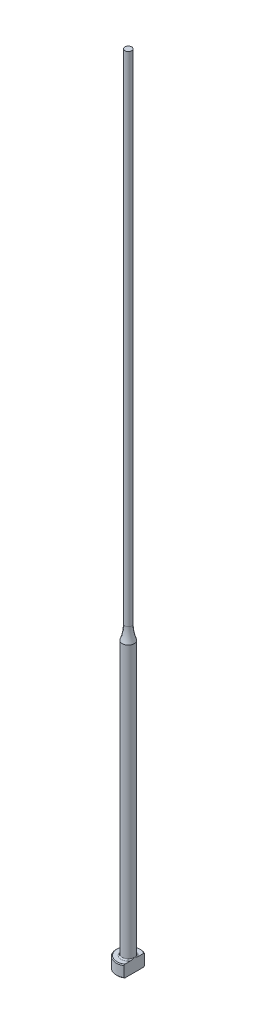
ISO-10303-21;
HEADER;
FILE_DESCRIPTION(('STEP AP214'),'2;1');
FILE_NAME('part.step','',(''),(''),'','','');
FILE_SCHEMA(('AUTOMOTIVE_DESIGN { 1 0 10303 214 1 1 1 1 }'));
ENDSEC;
DATA;
#1=APPLICATION_CONTEXT('core data for automotive mechanical design processes');
#2=APPLICATION_PROTOCOL_DEFINITION('international standard','automotive_design',2000,#1);
#3=PRODUCT_CONTEXT('',#1,'mechanical');
#4=PRODUCT('Part','Part','',(#3));
#5=PRODUCT_RELATED_PRODUCT_CATEGORY('part','',(#4));
#6=PRODUCT_DEFINITION_FORMATION('','',#4);
#7=PRODUCT_DEFINITION_CONTEXT('part definition',#1,'design');
#8=PRODUCT_DEFINITION('design','',#6,#7);
#9=PRODUCT_DEFINITION_SHAPE('','',#8);
#10=(LENGTH_UNIT() NAMED_UNIT(*) SI_UNIT(.MILLI.,.METRE.));
#11=(NAMED_UNIT(*) PLANE_ANGLE_UNIT() SI_UNIT($,.RADIAN.));
#12=(NAMED_UNIT(*) SI_UNIT($,.STERADIAN.) SOLID_ANGLE_UNIT());
#13=UNCERTAINTY_MEASURE_WITH_UNIT(LENGTH_MEASURE(1.E-05),#10,'distance_accuracy_value','');
#14=(GEOMETRIC_REPRESENTATION_CONTEXT(3) GLOBAL_UNCERTAINTY_ASSIGNED_CONTEXT((#13)) GLOBAL_UNIT_ASSIGNED_CONTEXT((#10,
#11,#12)) REPRESENTATION_CONTEXT('',''));
#15=CARTESIAN_POINT('',(0.,0.,0.));
#16=DIRECTION('',(0.,0.,1.));
#17=DIRECTION('',(1.,0.,0.));
#18=AXIS2_PLACEMENT_3D('',#15,#16,#17);
#19=CARTESIAN_POINT('',(-2.99999999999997,3.,0.));
#20=DIRECTION('',(0.,1.,0.));
#21=DIRECTION('',(0.,0.,1.));
#22=AXIS2_PLACEMENT_3D('',#19,#20,#21);
#23=PLANE('',#22);
#24=CARTESIAN_POINT('',(0.,3.,0.));
#25=DIRECTION('',(0.,1.,0.));
#26=DIRECTION('',(0.,0.,1.));
#27=AXIS2_PLACEMENT_3D('',#24,#25,#26);
#28=CIRCLE('',#27,2.79999999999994);
#29=CARTESIAN_POINT('',(1.49999999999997,3.,-2.36431808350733));
#30=VERTEX_POINT('',#29);
#31=CARTESIAN_POINT('',(1.49999999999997,3.,2.36431808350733));
#32=VERTEX_POINT('',#31);
#33=EDGE_CURVE('E187',#30,#32,#28,.T.);
#34=ORIENTED_EDGE('',*,*,#33,.T.);
#35=DIRECTION('',(0.,0.,-1.));
#36=VECTOR('',#35,1.);
#37=CARTESIAN_POINT('',(1.49999999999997,3.,0.));
#38=LINE('',#37,#36);
#39=CARTESIAN_POINT('',(1.49999999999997,3.00000000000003,0.99498743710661));
#40=VERTEX_POINT('',#39);
#41=EDGE_CURVE('E57',#32,#40,#38,.T.);
#42=ORIENTED_EDGE('',*,*,#41,.T.);
#43=CARTESIAN_POINT('',(0.,3.,0.));
#44=DIRECTION('',(0.,1.,0.));
#45=DIRECTION('',(0.,0.,1.));
#46=AXIS2_PLACEMENT_3D('',#43,#44,#45);
#47=CIRCLE('',#46,1.79999999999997);
#48=CARTESIAN_POINT('',(1.49999999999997,3.00000000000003,-0.994987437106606));
#49=VERTEX_POINT('',#48);
#50=EDGE_CURVE('E108',#40,#49,#47,.F.);
#51=ORIENTED_EDGE('',*,*,#50,.T.);
#52=EDGE_CURVE('E137',#49,#30,#38,.T.);
#53=ORIENTED_EDGE('',*,*,#52,.T.);
#54=EDGE_LOOP('',(#34,#42,#51,#53));
#55=FACE_BOUND('',#54,.T.);
#56=ADVANCED_FACE('F32',(#55),#23,.T.);
#57=CARTESIAN_POINT('',(0.,259.958771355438,0.));
#58=DIRECTION('',(0.,1.,0.));
#59=DIRECTION('',(0.,0.,1.));
#60=AXIS2_PLACEMENT_3D('',#57,#58,#59);
#61=CYLINDRICAL_SURFACE('',#60,2.99999999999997);
#62=CARTESIAN_POINT('',(0.,2.79999999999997,0.));
#63=DIRECTION('',(0.,1.,0.));
#64=DIRECTION('',(0.,0.,1.));
#65=AXIS2_PLACEMENT_3D('',#62,#63,#64);
#66=CIRCLE('',#65,2.99999999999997);
#67=CARTESIAN_POINT('',(1.49999999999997,2.79999999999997,2.5980762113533));
#68=VERTEX_POINT('',#67);
#69=CARTESIAN_POINT('',(1.49999999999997,2.79999999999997,-2.5980762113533));
#70=VERTEX_POINT('',#69);
#71=EDGE_CURVE('E105',#68,#70,#66,.F.);
#72=ORIENTED_EDGE('',*,*,#71,.T.);
#73=DIRECTION('',(0.,-1.,0.));
#74=VECTOR('',#73,1.);
#75=CARTESIAN_POINT('',(1.49999999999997,200.,-2.5980762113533));
#76=LINE('',#75,#74);
#77=CARTESIAN_POINT('',(1.49999999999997,0.200000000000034,-2.5980762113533));
#78=VERTEX_POINT('',#77);
#79=EDGE_CURVE('E193',#70,#78,#76,.T.);
#80=ORIENTED_EDGE('',*,*,#79,.T.);
#81=CARTESIAN_POINT('',(0.,0.200000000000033,0.));
#82=DIRECTION('',(0.,-1.,0.));
#83=DIRECTION('',(0.,0.,-1.));
#84=AXIS2_PLACEMENT_3D('',#81,#82,#83);
#85=CIRCLE('',#84,2.99999999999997);
#86=CARTESIAN_POINT('',(1.49999999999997,0.200000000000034,2.5980762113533));
#87=VERTEX_POINT('',#86);
#88=EDGE_CURVE('E100',#78,#87,#85,.F.);
#89=ORIENTED_EDGE('',*,*,#88,.T.);
#90=DIRECTION('',(0.,-1.,0.));
#91=VECTOR('',#90,1.);
#92=CARTESIAN_POINT('',(1.49999999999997,200.,2.5980762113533));
#93=LINE('',#92,#91);
#94=EDGE_CURVE('E93',#68,#87,#93,.T.);
#95=ORIENTED_EDGE('',*,*,#94,.F.);
#96=EDGE_LOOP('',(#72,#80,#89,#95));
#97=FACE_BOUND('',#96,.T.);
#98=ADVANCED_FACE('F158',(#97),#61,.T.);
#99=CARTESIAN_POINT('',(0.,0.,0.));
#100=DIRECTION('',(0.,-1.,0.));
#101=DIRECTION('',(0.,0.,-1.));
#102=AXIS2_PLACEMENT_3D('',#99,#100,#101);
#103=PLANE('',#102);
#104=CARTESIAN_POINT('',(0.,0.,0.));
#105=DIRECTION('',(0.,-1.,0.));
#106=DIRECTION('',(0.,0.,-1.));
#107=AXIS2_PLACEMENT_3D('',#104,#105,#106);
#108=CIRCLE('',#107,2.79999999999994);
#109=CARTESIAN_POINT('',(1.49999999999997,0.,2.36431808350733));
#110=VERTEX_POINT('',#109);
#111=CARTESIAN_POINT('',(1.49999999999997,0.,-2.36431808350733));
#112=VERTEX_POINT('',#111);
#113=EDGE_CURVE('E98',#110,#112,#108,.T.);
#114=ORIENTED_EDGE('',*,*,#113,.T.);
#115=DIRECTION('',(0.,0.,1.));
#116=VECTOR('',#115,1.);
#117=CARTESIAN_POINT('',(1.49999999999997,0.,-2.5980762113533));
#118=LINE('',#117,#116);
#119=EDGE_CURVE('E83',#112,#110,#118,.T.);
#120=ORIENTED_EDGE('',*,*,#119,.T.);
#121=EDGE_LOOP('',(#114,#120));
#122=FACE_BOUND('',#121,.T.);
#123=ADVANCED_FACE('F103',(#122),#103,.T.);
#124=CARTESIAN_POINT('',(0.,3.,0.));
#125=DIRECTION('',(0.,-1.,0.));
#126=DIRECTION('',(0.,0.,-1.));
#127=AXIS2_PLACEMENT_3D('',#124,#125,#126);
#128=CONICAL_SURFACE('',#127,2.79999999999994,0.785398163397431);
#129=ORIENTED_EDGE('',*,*,#71,.F.);
#130=CARTESIAN_POINT('',(1.49999999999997,-0.11174109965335,5.71827621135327));
#131=CARTESIAN_POINT('',(1.49999999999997,0.0136183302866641,5.58866816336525));
#132=CARTESIAN_POINT('',(1.49999999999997,0.138843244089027,5.45892957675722));
#133=CARTESIAN_POINT('',(1.49999999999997,0.388944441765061,5.19911365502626));
#134=CARTESIAN_POINT('',(1.49999999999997,0.513820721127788,5.06903631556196));
#135=CARTESIAN_POINT('',(1.49999999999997,0.763205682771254,4.80840180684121));
#136=CARTESIAN_POINT('',(1.49999999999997,0.887714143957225,4.67784442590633));
#137=CARTESIAN_POINT('',(1.49999999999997,1.13618059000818,4.4162081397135));
#138=CARTESIAN_POINT('',(1.49999999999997,1.26013857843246,4.28512923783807));
#139=CARTESIAN_POINT('',(1.49999999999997,1.50488975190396,4.02490837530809));
#140=CARTESIAN_POINT('',(1.49999999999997,1.62569693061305,3.8957795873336));
#141=CARTESIAN_POINT('',(1.49999999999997,1.86640694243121,3.63668213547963));
#142=CARTESIAN_POINT('',(1.49999999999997,1.98630978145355,3.50671347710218));
#143=CARTESIAN_POINT('',(1.49999999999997,2.2248603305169,3.24567921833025));
#144=CARTESIAN_POINT('',(1.49999999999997,2.3435083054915,3.11461386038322));
#145=CARTESIAN_POINT('',(1.49999999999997,2.5790771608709,2.85094268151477));
#146=CARTESIAN_POINT('',(1.49999999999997,2.69599811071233,2.71833692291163));
#147=CARTESIAN_POINT('',(1.49999999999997,2.88262371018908,2.50255231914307));
#148=CARTESIAN_POINT('',(1.49999999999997,2.95312454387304,2.42006293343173));
#149=CARTESIAN_POINT('',(1.49999999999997,3.09287098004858,2.25401084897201));
#150=CARTESIAN_POINT('',(1.49999999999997,3.16211645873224,2.17044804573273));
#151=CARTESIAN_POINT('',(1.49999999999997,3.29964684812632,2.00105967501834));
#152=CARTESIAN_POINT('',(1.49999999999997,3.36791386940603,1.9152195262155));
#153=CARTESIAN_POINT('',(1.49999999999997,3.50205840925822,1.7417139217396));
#154=CARTESIAN_POINT('',(1.49999999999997,3.56793649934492,1.65404891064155));
#155=CARTESIAN_POINT('',(1.49999999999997,3.69728151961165,1.47490236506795));
#156=CARTESIAN_POINT('',(1.49999999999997,3.76069661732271,1.38338308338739));
#157=CARTESIAN_POINT('',(1.49999999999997,3.88239539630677,1.19675661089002));
#158=CARTESIAN_POINT('',(1.49999999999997,3.94067201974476,1.10164473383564));
#159=CARTESIAN_POINT('',(1.49999999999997,4.048413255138,0.908008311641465));
#160=CARTESIAN_POINT('',(1.49999999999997,4.09797809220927,0.809540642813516));
#161=CARTESIAN_POINT('',(1.49999999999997,4.18432188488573,0.60719295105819));
#162=CARTESIAN_POINT('',(1.49999999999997,4.22114374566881,0.503332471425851));
#163=CARTESIAN_POINT('',(1.49999999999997,4.26099935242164,0.3475775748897));
#164=CARTESIAN_POINT('',(1.49999999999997,4.2715702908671,0.297609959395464));
#165=CARTESIAN_POINT('',(1.49999999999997,4.28794860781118,0.196885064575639));
#166=CARTESIAN_POINT('',(1.49999999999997,4.29375640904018,0.146127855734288));
#167=CARTESIAN_POINT('',(1.49999999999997,4.30019707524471,0.0444388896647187));
#168=CARTESIAN_POINT('',(1.49999999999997,4.30084594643,-0.00649183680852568));
#169=CARTESIAN_POINT('',(1.49999999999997,4.29696416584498,-0.108155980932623));
#170=CARTESIAN_POINT('',(1.49999999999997,4.29243308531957,-0.158889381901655));
#171=CARTESIAN_POINT('',(1.49999999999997,4.27856915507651,-0.259234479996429));
#172=CARTESIAN_POINT('',(1.49999999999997,4.2692782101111,-0.308852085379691));
#173=CARTESIAN_POINT('',(1.49999999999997,4.24647108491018,-0.407110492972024));
#174=CARTESIAN_POINT('',(1.49999999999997,4.23295324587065,-0.45575090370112));
#175=CARTESIAN_POINT('',(1.49999999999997,4.20226175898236,-0.55214996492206));
#176=CARTESIAN_POINT('',(1.49999999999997,4.18506801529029,-0.599902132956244));
#177=CARTESIAN_POINT('',(1.49999999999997,4.14771387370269,-0.694205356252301));
#178=CARTESIAN_POINT('',(1.49999999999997,4.12755408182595,-0.740756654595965));
#179=CARTESIAN_POINT('',(1.49999999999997,4.0632769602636,-0.879166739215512));
#180=CARTESIAN_POINT('',(1.49999999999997,4.01551721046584,-0.969329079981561));
#181=CARTESIAN_POINT('',(1.49999999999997,3.91367909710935,-1.14604316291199));
#182=CARTESIAN_POINT('',(1.49999999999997,3.85959300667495,-1.2325903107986));
#183=CARTESIAN_POINT('',(1.49999999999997,3.74697968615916,-1.40321348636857));
#184=CARTESIAN_POINT('',(1.49999999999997,3.68843573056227,-1.4872783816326));
#185=CARTESIAN_POINT('',(1.49999999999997,3.5684384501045,-1.65322187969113));
#186=CARTESIAN_POINT('',(1.49999999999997,3.50698656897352,-1.73510153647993));
#187=CARTESIAN_POINT('',(1.49999999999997,3.3811567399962,-1.89829823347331));
#188=CARTESIAN_POINT('',(1.49999999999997,3.31675092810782,-1.97959369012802));
#189=CARTESIAN_POINT('',(1.49999999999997,3.18634068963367,-2.14090082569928));
#190=CARTESIAN_POINT('',(1.49999999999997,3.12033609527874,-2.22091236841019));
#191=CARTESIAN_POINT('',(1.49999999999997,2.92086431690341,-2.45906508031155));
#192=CARTESIAN_POINT('',(1.49999999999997,2.78562663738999,-2.61572090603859));
#193=CARTESIAN_POINT('',(1.49999999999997,2.53554498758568,-2.90006295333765));
#194=CARTESIAN_POINT('',(1.49999999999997,2.42114543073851,-3.02814382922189));
#195=CARTESIAN_POINT('',(1.49999999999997,2.1909355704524,-3.28303767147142));
#196=CARTESIAN_POINT('',(1.49999999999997,2.07512522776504,-3.40985060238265));
#197=CARTESIAN_POINT('',(1.49999999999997,1.72597067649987,-3.78913849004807));
#198=CARTESIAN_POINT('',(1.49999999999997,1.49111760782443,-4.04022177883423));
#199=CARTESIAN_POINT('',(1.49999999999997,1.0288247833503,-4.52992803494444));
#200=CARTESIAN_POINT('',(1.49999999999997,0.801477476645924,-4.76863870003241));
#201=CARTESIAN_POINT('',(1.49999999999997,0.459548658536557,-5.12558036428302));
#202=CARTESIAN_POINT('',(1.49999999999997,0.345484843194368,-5.24430773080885));
#203=CARTESIAN_POINT('',(1.49999999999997,0.117071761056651,-5.48148573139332));
#204=CARTESIAN_POINT('',(1.49999999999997,0.00272249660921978,-5.59993636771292));
#205=CARTESIAN_POINT('',(1.49999999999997,-0.11174109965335,-5.71827621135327));
#206=B_SPLINE_CURVE_WITH_KNOTS('',3,(#130,#131,#132,#133,#134,#135,#136,#137,#138,#139,#140,
#141,#142,#143,#144,#145,#146,#147,#148,#149,#150,#151,#152,#153,#154,#155,#156,#157,#158,#159,
#160,#161,#162,#163,#164,#165,#166,#167,#168,#169,#170,#171,#172,#173,#174,#175,#176,#177,#178,
#179,#180,#181,#182,#183,#184,#185,#186,#187,#188,#189,#190,#191,#192,#193,#194,#195,#196,#197,
#198,#199,#200,#201,#202,#203,#204,#205),.UNSPECIFIED.,.F.,.F.,(4,2,2,2,2,2,2,2,2,2,2,2,2,2,2,2,
2,2,2,2,2,2,2,2,2,2,2,2,2,2,2,2,2,2,2,2,2,4),(0.,0.540943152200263,1.08189327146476,
1.62312052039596,2.16434426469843,2.69482920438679,3.22531067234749,3.75567781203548,
4.28602356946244,4.61155053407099,4.9371094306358,5.26610945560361,5.59503024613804,
5.92894782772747,6.26331713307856,6.59354403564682,6.92264800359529,7.07567478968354,
7.2286879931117,7.38122626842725,7.53377717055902,7.6850075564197,7.83629736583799,
7.98843643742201,8.14054446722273,8.44618799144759,8.75220879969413,9.05944044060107,
9.3665211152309,9.6776428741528,9.98879742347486,10.609592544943,11.1247803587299,
11.6399825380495,12.6713544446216,13.6603005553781,14.1542238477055,14.6481430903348),.UNSPECIFIED.);
#207=EDGE_CURVE('E136',#68,#32,#206,.T.);
#208=ORIENTED_EDGE('',*,*,#207,.T.);
#209=ORIENTED_EDGE('',*,*,#33,.F.);
#210=EDGE_CURVE('E128',#30,#70,#206,.T.);
#211=ORIENTED_EDGE('',*,*,#210,.T.);
#212=EDGE_LOOP('',(#129,#208,#209,#211));
#213=FACE_BOUND('',#212,.T.);
#214=ADVANCED_FACE('F144',(#213),#128,.T.);
#215=CARTESIAN_POINT('',(0.,0.200000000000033,0.));
#216=DIRECTION('',(0.,1.,0.));
#217=DIRECTION('',(0.,0.,1.));
#218=AXIS2_PLACEMENT_3D('',#215,#216,#217);
#219=CONICAL_SURFACE('',#218,2.99999999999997,0.785398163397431);
#220=ORIENTED_EDGE('',*,*,#88,.F.);
#221=CARTESIAN_POINT('',(1.49999999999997,3.11174109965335,-5.71827621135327));
#222=CARTESIAN_POINT('',(1.49999999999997,2.98638166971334,-5.58866816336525));
#223=CARTESIAN_POINT('',(1.49999999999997,2.86115675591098,-5.45892957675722));
#224=CARTESIAN_POINT('',(1.49999999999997,2.61105555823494,-5.19911365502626));
#225=CARTESIAN_POINT('',(1.49999999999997,2.48617927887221,-5.06903631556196));
#226=CARTESIAN_POINT('',(1.49999999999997,2.23679431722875,-4.80840180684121));
#227=CARTESIAN_POINT('',(1.49999999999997,2.11228585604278,-4.67784442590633));
#228=CARTESIAN_POINT('',(1.49999999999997,1.86381940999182,-4.4162081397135));
#229=CARTESIAN_POINT('',(1.49999999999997,1.73986142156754,-4.28512923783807));
#230=CARTESIAN_POINT('',(1.49999999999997,1.49511024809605,-4.02490837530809));
#231=CARTESIAN_POINT('',(1.49999999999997,1.37430306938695,-3.8957795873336));
#232=CARTESIAN_POINT('',(1.49999999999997,1.13359305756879,-3.63668213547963));
#233=CARTESIAN_POINT('',(1.49999999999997,1.01369021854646,-3.50671347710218));
#234=CARTESIAN_POINT('',(1.49999999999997,0.775139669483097,-3.24567921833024));
#235=CARTESIAN_POINT('',(1.49999999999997,0.656491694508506,-3.11461386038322));
#236=CARTESIAN_POINT('',(1.49999999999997,0.420922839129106,-2.85094268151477));
#237=CARTESIAN_POINT('',(1.49999999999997,0.304001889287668,-2.71833692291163));
#238=CARTESIAN_POINT('',(1.49999999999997,0.117376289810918,-2.50255231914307));
#239=CARTESIAN_POINT('',(1.49999999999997,0.0468754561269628,-2.42006293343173));
#240=CARTESIAN_POINT('',(1.49999999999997,-0.0928709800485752,-2.254010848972));
#241=CARTESIAN_POINT('',(1.49999999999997,-0.162116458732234,-2.17044804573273));
#242=CARTESIAN_POINT('',(1.49999999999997,-0.299646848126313,-2.00105967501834));
#243=CARTESIAN_POINT('',(1.49999999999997,-0.367913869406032,-1.9152195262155));
#244=CARTESIAN_POINT('',(1.49999999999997,-0.502058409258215,-1.7417139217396));
#245=CARTESIAN_POINT('',(1.49999999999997,-0.567936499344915,-1.65404891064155));
#246=CARTESIAN_POINT('',(1.49999999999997,-0.697281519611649,-1.47490236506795));
#247=CARTESIAN_POINT('',(1.49999999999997,-0.760696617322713,-1.38338308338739));
#248=CARTESIAN_POINT('',(1.49999999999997,-0.882395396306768,-1.19675661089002));
#249=CARTESIAN_POINT('',(1.49999999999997,-0.940672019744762,-1.10164473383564));
#250=CARTESIAN_POINT('',(1.49999999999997,-1.04841325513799,-0.908008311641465));
#251=CARTESIAN_POINT('',(1.49999999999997,-1.09797809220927,-0.809540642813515));
#252=CARTESIAN_POINT('',(1.49999999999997,-1.18432188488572,-0.607192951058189));
#253=CARTESIAN_POINT('',(1.49999999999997,-1.22114374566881,-0.503332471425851));
#254=CARTESIAN_POINT('',(1.49999999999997,-1.26099935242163,-0.3475775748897));
#255=CARTESIAN_POINT('',(1.49999999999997,-1.2715702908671,-0.297609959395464));
#256=CARTESIAN_POINT('',(1.49999999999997,-1.28794860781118,-0.19688506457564));
#257=CARTESIAN_POINT('',(1.49999999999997,-1.29375640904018,-0.146127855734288));
#258=CARTESIAN_POINT('',(1.49999999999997,-1.30019707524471,-0.0444388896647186));
#259=CARTESIAN_POINT('',(1.49999999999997,-1.30084594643,0.00649183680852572));
#260=CARTESIAN_POINT('',(1.49999999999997,-1.29696416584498,0.108155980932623));
#261=CARTESIAN_POINT('',(1.49999999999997,-1.29243308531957,0.158889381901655));
#262=CARTESIAN_POINT('',(1.49999999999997,-1.2785691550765,0.259234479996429));
#263=CARTESIAN_POINT('',(1.49999999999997,-1.2692782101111,0.308852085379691));
#264=CARTESIAN_POINT('',(1.49999999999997,-1.24647108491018,0.407110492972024));
#265=CARTESIAN_POINT('',(1.49999999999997,-1.23295324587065,0.45575090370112));
#266=CARTESIAN_POINT('',(1.49999999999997,-1.20226175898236,0.55214996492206));
#267=CARTESIAN_POINT('',(1.49999999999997,-1.18506801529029,0.599902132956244));
#268=CARTESIAN_POINT('',(1.49999999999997,-1.14771387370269,0.694205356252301));
#269=CARTESIAN_POINT('',(1.49999999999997,-1.12755408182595,0.740756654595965));
#270=CARTESIAN_POINT('',(1.49999999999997,-1.0632769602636,0.879166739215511));
#271=CARTESIAN_POINT('',(1.49999999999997,-1.01551721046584,0.96932907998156));
#272=CARTESIAN_POINT('',(1.49999999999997,-0.913679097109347,1.14604316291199));
#273=CARTESIAN_POINT('',(1.49999999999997,-0.85959300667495,1.2325903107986));
#274=CARTESIAN_POINT('',(1.49999999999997,-0.74697968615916,1.40321348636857));
#275=CARTESIAN_POINT('',(1.49999999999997,-0.688435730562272,1.4872783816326));
#276=CARTESIAN_POINT('',(1.49999999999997,-0.568438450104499,1.65322187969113));
#277=CARTESIAN_POINT('',(1.49999999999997,-0.50698656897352,1.73510153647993));
#278=CARTESIAN_POINT('',(1.49999999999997,-0.381156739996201,1.89829823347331));
#279=CARTESIAN_POINT('',(1.49999999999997,-0.316750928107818,1.97959369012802));
#280=CARTESIAN_POINT('',(1.49999999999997,-0.186340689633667,2.14090082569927));
#281=CARTESIAN_POINT('',(1.49999999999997,-0.120336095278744,2.22091236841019));
#282=CARTESIAN_POINT('',(1.49999999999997,0.0791356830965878,2.45906508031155));
#283=CARTESIAN_POINT('',(1.49999999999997,0.214373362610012,2.61572090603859));
#284=CARTESIAN_POINT('',(1.49999999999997,0.464455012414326,2.90006295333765));
#285=CARTESIAN_POINT('',(1.49999999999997,0.578854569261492,3.02814382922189));
#286=CARTESIAN_POINT('',(1.49999999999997,0.809064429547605,3.28303767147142));
#287=CARTESIAN_POINT('',(1.49999999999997,0.924874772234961,3.40985060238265));
#288=CARTESIAN_POINT('',(1.49999999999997,1.27402932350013,3.78913849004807));
#289=CARTESIAN_POINT('',(1.49999999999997,1.50888239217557,4.04022177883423));
#290=CARTESIAN_POINT('',(1.49999999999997,1.97117521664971,4.52992803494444));
#291=CARTESIAN_POINT('',(1.49999999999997,2.19852252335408,4.76863870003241));
#292=CARTESIAN_POINT('',(1.49999999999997,2.54045134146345,5.12558036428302));
#293=CARTESIAN_POINT('',(1.49999999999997,2.65451515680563,5.24430773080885));
#294=CARTESIAN_POINT('',(1.49999999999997,2.88292823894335,5.48148573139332));
#295=CARTESIAN_POINT('',(1.49999999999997,2.99727750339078,5.59993636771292));
#296=CARTESIAN_POINT('',(1.49999999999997,3.11174109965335,5.71827621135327));
#297=B_SPLINE_CURVE_WITH_KNOTS('',3,(#221,#222,#223,#224,#225,#226,#227,#228,#229,#230,#231,
#232,#233,#234,#235,#236,#237,#238,#239,#240,#241,#242,#243,#244,#245,#246,#247,#248,#249,#250,
#251,#252,#253,#254,#255,#256,#257,#258,#259,#260,#261,#262,#263,#264,#265,#266,#267,#268,#269,
#270,#271,#272,#273,#274,#275,#276,#277,#278,#279,#280,#281,#282,#283,#284,#285,#286,#287,#288,
#289,#290,#291,#292,#293,#294,#295,#296),.UNSPECIFIED.,.F.,.F.,(4,2,2,2,2,2,2,2,2,2,2,2,2,2,2,2,
2,2,2,2,2,2,2,2,2,2,2,2,2,2,2,2,2,2,2,2,2,4),(0.,0.540943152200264,1.08189327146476,
1.62312052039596,2.16434426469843,2.69482920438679,3.22531067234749,3.75567781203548,
4.28602356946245,4.611550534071,4.9371094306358,5.26610945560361,5.59503024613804,
5.92894782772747,6.26331713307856,6.59354403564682,6.92264800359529,7.07567478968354,
7.2286879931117,7.38122626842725,7.53377717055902,7.6850075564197,7.83629736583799,
7.98843643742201,8.14054446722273,8.44618799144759,8.75220879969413,9.05944044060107,
9.3665211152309,9.6776428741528,9.98879742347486,10.609592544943,11.1247803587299,
11.6399825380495,12.6713544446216,13.6603005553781,14.1542238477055,14.6481430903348),.UNSPECIFIED.);
#298=EDGE_CURVE('E86',#78,#112,#297,.T.);
#299=ORIENTED_EDGE('',*,*,#298,.T.);
#300=ORIENTED_EDGE('',*,*,#113,.F.);
#301=EDGE_CURVE('E89',#110,#87,#297,.T.);
#302=ORIENTED_EDGE('',*,*,#301,.T.);
#303=EDGE_LOOP('',(#220,#299,#300,#302));
#304=FACE_BOUND('',#303,.T.);
#305=ADVANCED_FACE('F97',(#304),#219,.T.);
#306=CARTESIAN_POINT('',(0.,3.30000000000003,0.));
#307=DIRECTION('',(0.,1.,0.));
#308=DIRECTION('',(0.,0.,1.));
#309=AXIS2_PLACEMENT_3D('',#306,#307,#308);
#310=TOROIDAL_SURFACE('',#309,1.79999999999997,0.3);
#311=CARTESIAN_POINT('',(1.49999999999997,3.30000000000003,0.));
#312=CARTESIAN_POINT('',(1.49999999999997,3.300000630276,3.41555678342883E-12));
#313=CARTESIAN_POINT('',(1.49999999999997,3.30000126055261,-1.15373640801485E-07));
#314=CARTESIAN_POINT('',(1.49999999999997,3.3000024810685,-4.90631575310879E-07));
#315=CARTESIAN_POINT('',(1.49999999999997,3.30000307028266,-7.53296670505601E-07));
#316=CARTESIAN_POINT('',(1.49999999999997,3.30000424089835,-1.38757096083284E-06));
#317=CARTESIAN_POINT('',(1.49999999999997,3.300004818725,-1.76563001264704E-06));
#318=CARTESIAN_POINT('',(1.49999999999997,3.30000591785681,-2.58768006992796E-06));
#319=CARTESIAN_POINT('',(1.49999999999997,3.30000643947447,-3.03127014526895E-06));
#320=CARTESIAN_POINT('',(1.49999999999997,3.30000815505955,-4.60021967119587E-06));
#321=CARTESIAN_POINT('',(1.49999999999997,3.30000927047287,-5.8124152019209E-06));
#322=CARTESIAN_POINT('',(1.49999999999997,3.30001128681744,-8.33989413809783E-06));
#323=CARTESIAN_POINT('',(1.49999999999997,3.30001219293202,-9.65128157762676E-06));
#324=CARTESIAN_POINT('',(1.49999999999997,3.30001551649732,-1.46782505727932E-05));
#325=CARTESIAN_POINT('',(1.49999999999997,3.30001775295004,-1.8517976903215E-05));
#326=CARTESIAN_POINT('',(1.49999999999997,3.30002148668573,-2.61616194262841E-05));
#327=CARTESIAN_POINT('',(1.49999999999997,3.30002302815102,-2.99447742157E-05));
#328=CARTESIAN_POINT('',(1.49999999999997,3.30002943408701,-4.58003743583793E-05));
#329=CARTESIAN_POINT('',(1.49999999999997,3.3000341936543,-5.79079078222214E-05));
#330=CARTESIAN_POINT('',(1.49999999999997,3.30004197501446,-8.07263755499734E-05));
#331=CARTESIAN_POINT('',(1.49999999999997,3.30004514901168,-9.13834709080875E-05));
#332=CARTESIAN_POINT('',(1.49999999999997,3.30006989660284,-0.000167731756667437));
#333=CARTESIAN_POINT('',(1.49999999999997,3.30010092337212,-0.000229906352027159));
#334=CARTESIAN_POINT('',(1.49999999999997,3.30021632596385,-0.000470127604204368));
#335=CARTESIAN_POINT('',(1.49999999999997,3.30029368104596,-0.000650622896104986));
#336=CARTESIAN_POINT('',(1.49999999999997,3.30059619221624,-0.00134589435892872));
#337=CARTESIAN_POINT('',(1.49999999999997,3.30082870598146,-0.00185814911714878));
#338=CARTESIAN_POINT('',(1.49999999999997,3.30176696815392,-0.00393547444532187));
#339=CARTESIAN_POINT('',(1.49999999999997,3.30246445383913,-0.00550332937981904));
#340=CARTESIAN_POINT('',(1.49999999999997,3.31426785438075,-0.0320229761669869));
#341=CARTESIAN_POINT('',(1.49999999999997,3.32544800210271,-0.0569503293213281));
#342=CARTESIAN_POINT('',(1.49999999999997,3.34725700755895,-0.105984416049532));
#343=CARTESIAN_POINT('',(1.49999999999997,3.35789134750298,-0.130088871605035));
#344=CARTESIAN_POINT('',(1.49999999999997,3.38015321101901,-0.181096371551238));
#345=CARTESIAN_POINT('',(1.49999999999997,3.39175804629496,-0.208009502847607));
#346=CARTESIAN_POINT('',(1.49999999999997,3.41469034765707,-0.262264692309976));
#347=CARTESIAN_POINT('',(1.49999999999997,3.42601398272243,-0.289608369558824));
#348=CARTESIAN_POINT('',(1.49999999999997,3.45363212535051,-0.35820378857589));
#349=CARTESIAN_POINT('',(1.49999999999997,3.46959026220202,-0.39959288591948));
#350=CARTESIAN_POINT('',(1.49999999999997,3.49940505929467,-0.482097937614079));
#351=CARTESIAN_POINT('',(1.49999999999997,3.51330033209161,-0.523199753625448));
#352=CARTESIAN_POINT('',(1.49999999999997,3.53552507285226,-0.595497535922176));
#353=CARTESIAN_POINT('',(1.49999999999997,3.54436834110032,-0.626532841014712));
#354=CARTESIAN_POINT('',(1.49999999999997,3.56052427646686,-0.6891760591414));
#355=CARTESIAN_POINT('',(1.49999999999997,3.5678279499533,-0.720786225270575));
#356=CARTESIAN_POINT('',(1.49999999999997,3.5875075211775,-0.819524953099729));
#357=CARTESIAN_POINT('',(1.49999999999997,3.59661044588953,-0.88742909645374));
#358=CARTESIAN_POINT('',(1.49999999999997,3.60059842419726,-0.991180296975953));
#359=CARTESIAN_POINT('',(1.49999999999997,3.60019840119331,-1.02684364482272));
#360=CARTESIAN_POINT('',(1.49999999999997,3.59497085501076,-1.097505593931));
#361=CARTESIAN_POINT('',(1.49999999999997,3.59019295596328,-1.13250716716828));
#362=CARTESIAN_POINT('',(1.49999999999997,3.57687734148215,-1.19353096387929));
#363=CARTESIAN_POINT('',(1.49999999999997,3.56943875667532,-1.21978854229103));
#364=CARTESIAN_POINT('',(1.49999999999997,3.55063748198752,-1.27094658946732));
#365=CARTESIAN_POINT('',(1.49999999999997,3.53927342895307,-1.29584658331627));
#366=CARTESIAN_POINT('',(1.49999999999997,3.51660016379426,-1.33501873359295));
#367=CARTESIAN_POINT('',(1.49999999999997,3.50657738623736,-1.35003296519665));
#368=CARTESIAN_POINT('',(1.49999999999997,3.48437469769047,-1.37837252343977));
#369=CARTESIAN_POINT('',(1.49999999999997,3.47219867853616,-1.39170082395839));
#370=CARTESIAN_POINT('',(1.49999999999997,3.44835614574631,-1.41349417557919));
#371=CARTESIAN_POINT('',(1.49999999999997,3.43709185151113,-1.42239673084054));
#372=CARTESIAN_POINT('',(1.49999999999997,3.41325256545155,-1.43825467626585));
#373=CARTESIAN_POINT('',(1.49999999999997,3.40067804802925,-1.44521076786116));
#374=CARTESIAN_POINT('',(1.49999999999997,3.37433767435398,-1.45677158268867));
#375=CARTESIAN_POINT('',(1.49999999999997,3.36056203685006,-1.46135438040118));
#376=CARTESIAN_POINT('',(1.49999999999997,3.33237324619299,-1.46767730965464));
#377=CARTESIAN_POINT('',(1.49999999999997,3.31796076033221,-1.46942034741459));
#378=CARTESIAN_POINT('',(1.49999999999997,3.29122479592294,-1.4698720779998));
#379=CARTESIAN_POINT('',(1.49999999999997,3.27890664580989,-1.468990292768));
#380=CARTESIAN_POINT('',(1.49999999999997,3.25461019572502,-1.4651157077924));
#381=CARTESIAN_POINT('',(1.49999999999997,3.2426318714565,-1.46212305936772));
#382=CARTESIAN_POINT('',(1.49999999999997,3.21959683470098,-1.4543117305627));
#383=CARTESIAN_POINT('',(1.49999999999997,3.20852542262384,-1.44953579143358));
#384=CARTESIAN_POINT('',(1.49999999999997,3.18721125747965,-1.43840957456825));
#385=CARTESIAN_POINT('',(1.49999999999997,3.1769687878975,-1.43205876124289));
#386=CARTESIAN_POINT('',(1.49999999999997,3.15325976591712,-1.41506353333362));
#387=CARTESIAN_POINT('',(1.49999999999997,3.14027750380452,-1.40374235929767));
#388=CARTESIAN_POINT('',(1.49999999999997,3.11630720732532,-1.37914825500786));
#389=CARTESIAN_POINT('',(1.49999999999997,3.10532420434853,-1.36587054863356));
#390=CARTESIAN_POINT('',(1.49999999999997,3.08100891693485,-1.33197272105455));
#391=CARTESIAN_POINT('',(1.49999999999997,3.06867625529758,-1.31063843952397));
#392=CARTESIAN_POINT('',(1.49999999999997,3.04751867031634,-1.26637455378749));
#393=CARTESIAN_POINT('',(1.49999999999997,3.03869240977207,-1.24344556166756));
#394=CARTESIAN_POINT('',(1.49999999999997,3.01978360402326,-1.18316534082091));
#395=CARTESIAN_POINT('',(1.49999999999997,3.01191472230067,-1.14512623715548));
#396=CARTESIAN_POINT('',(1.49999999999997,3.00188285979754,-1.06789971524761));
#397=CARTESIAN_POINT('',(1.49999999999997,2.99979735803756,-1.02870374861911));
#398=CARTESIAN_POINT('',(1.49999999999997,3.00021727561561,-0.953160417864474));
#399=CARTESIAN_POINT('',(1.49999999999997,3.00240673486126,-0.916808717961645));
#400=CARTESIAN_POINT('',(1.49999999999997,3.0099643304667,-0.844432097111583));
#401=CARTESIAN_POINT('',(1.49999999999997,3.01533462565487,-0.808407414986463));
#402=CARTESIAN_POINT('',(1.49999999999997,3.02828086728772,-0.738670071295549));
#403=CARTESIAN_POINT('',(1.49999999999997,3.03573028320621,-0.704933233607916));
#404=CARTESIAN_POINT('',(1.49999999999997,3.05243174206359,-0.638128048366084));
#405=CARTESIAN_POINT('',(1.49999999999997,3.06167285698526,-0.605056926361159));
#406=CARTESIAN_POINT('',(1.49999999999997,3.08440652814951,-0.53019513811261));
#407=CARTESIAN_POINT('',(1.49999999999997,3.09836576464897,-0.488547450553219));
#408=CARTESIAN_POINT('',(1.49999999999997,3.1283820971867,-0.404954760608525));
#409=CARTESIAN_POINT('',(1.49999999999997,3.14447968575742,-0.363024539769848));
#410=CARTESIAN_POINT('',(1.49999999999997,3.17238454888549,-0.293508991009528));
#411=CARTESIAN_POINT('',(1.49999999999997,3.18384249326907,-0.265781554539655));
#412=CARTESIAN_POINT('',(1.49999999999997,3.20705854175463,-0.210769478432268));
#413=CARTESIAN_POINT('',(1.49999999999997,3.21881265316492,-0.183483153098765));
#414=CARTESIAN_POINT('',(1.49999999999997,3.24136702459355,-0.131772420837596));
#415=CARTESIAN_POINT('',(1.49999999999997,3.25214361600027,-0.107337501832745));
#416=CARTESIAN_POINT('',(1.49999999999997,3.27424746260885,-0.0576321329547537));
#417=CARTESIAN_POINT('',(1.49999999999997,3.28558038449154,-0.0323640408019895));
#418=CARTESIAN_POINT('',(1.49999999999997,3.29753556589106,-0.00550327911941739));
#419=CARTESIAN_POINT('',(1.49999999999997,3.29823307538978,-0.00393537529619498));
#420=CARTESIAN_POINT('',(1.49999999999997,3.29917134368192,-0.00185803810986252));
#421=CARTESIAN_POINT('',(1.49999999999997,3.29940384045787,-0.00134582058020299));
#422=CARTESIAN_POINT('',(1.49999999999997,3.29970633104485,-0.000650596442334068));
#423=CARTESIAN_POINT('',(1.49999999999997,3.29978368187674,-0.000470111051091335));
#424=CARTESIAN_POINT('',(1.49999999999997,3.29989907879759,-0.000229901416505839));
#425=CARTESIAN_POINT('',(1.49999999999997,3.29993010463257,-0.000167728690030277));
#426=CARTESIAN_POINT('',(1.49999999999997,3.29995485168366,-9.13825689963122E-05));
#427=CARTESIAN_POINT('',(1.49999999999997,3.29995802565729,-8.07256241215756E-05));
#428=CARTESIAN_POINT('',(1.49999999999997,3.29996580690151,-5.79074820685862E-05));
#429=CARTESIAN_POINT('',(1.49999999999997,3.29997056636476,-4.5800119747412E-05));
#430=CARTESIAN_POINT('',(1.49999999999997,3.29997697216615,-2.99447119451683E-05));
#431=CARTESIAN_POINT('',(1.49999999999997,3.2999785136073,-2.61615817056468E-05));
#432=CARTESIAN_POINT('',(1.49999999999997,3.2999822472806,-1.85179845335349E-05));
#433=CARTESIAN_POINT('',(1.49999999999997,3.29998448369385,-1.46782782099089E-05));
#434=CARTESIAN_POINT('',(1.49999999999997,3.2999878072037,-9.65132752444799E-06));
#435=CARTESIAN_POINT('',(1.49999999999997,3.299988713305,-8.33994202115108E-06));
#436=CARTESIAN_POINT('',(1.49999999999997,3.29999072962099,-5.81246426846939E-06));
#437=CARTESIAN_POINT('',(1.49999999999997,3.29999184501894,-4.600267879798E-06));
#438=CARTESIAN_POINT('',(1.49999999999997,3.29999356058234,-3.03131394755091E-06));
#439=CARTESIAN_POINT('',(1.49999999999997,3.29999408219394,-2.58772196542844E-06));
#440=CARTESIAN_POINT('',(1.49999999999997,3.2999951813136,-1.76566701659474E-06));
#441=CARTESIAN_POINT('',(1.49999999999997,3.29999575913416,-1.38760497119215E-06));
#442=CARTESIAN_POINT('',(1.49999999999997,3.29999692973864,-7.53323425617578E-07));
#443=CARTESIAN_POINT('',(1.49999999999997,3.29999751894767,-4.90654189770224E-07));
#444=CARTESIAN_POINT('',(1.49999999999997,3.29999873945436,-1.15386267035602E-07));
#445=CARTESIAN_POINT('',(1.49999999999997,3.29999936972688,-3.41554144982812E-12));
#446=CARTESIAN_POINT('',(1.49999999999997,3.30000000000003,0.));
#447=B_SPLINE_CURVE_WITH_KNOTS('',3,(#311,#312,#313,#314,#315,#316,#317,#318,#319,#320,#321,
#322,#323,#324,#325,#326,#327,#328,#329,#330,#331,#332,#333,#334,#335,#336,#337,#338,#339,#340,
#341,#342,#343,#344,#345,#346,#347,#348,#349,#350,#351,#352,#353,#354,#355,#356,#357,#358,#359,
#360,#361,#362,#363,#364,#365,#366,#367,#368,#369,#370,#371,#372,#373,#374,#375,#376,#377,#378,
#379,#380,#381,#382,#383,#384,#385,#386,#387,#388,#389,#390,#391,#392,#393,#394,#395,#396,#397,
#398,#399,#400,#401,#402,#403,#404,#405,#406,#407,#408,#409,#410,#411,#412,#413,#414,#415,#416,
#417,#418,#419,#420,#421,#422,#423,#424,#425,#426,#427,#428,#429,#430,#431,#432,#433,#434,#435,
#436,#437,#438,#439,#440,#441,#442,#443,#444,#445,#446),.UNSPECIFIED.,.T.,.F.,(4,2,2,2,2,2,2,2,
2,2,2,2,2,2,2,2,2,2,2,2,2,2,2,2,2,2,2,2,2,2,2,2,2,2,2,2,2,2,2,2,2,2,2,2,2,2,2,2,2,2,2,2,2,2,2,2,
2,2,2,2,2,2,2,2,2,2,2,4),(0.,1.88906036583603E-06,3.8150959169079E-06,5.87892837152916E-06,
7.93062024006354E-06,1.28480890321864E-05,1.76261717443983E-05,3.0909918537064E-05,
4.31529750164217E-05,8.21699329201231E-05,0.000115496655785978,0.000323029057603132,
0.000912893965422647,0.00259963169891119,0.00774858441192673,0.0896975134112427,
0.168737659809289,0.256660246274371,0.345444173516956,0.478492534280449,0.608603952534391,
0.705372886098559,0.802692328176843,1.00719557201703,1.11399616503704,1.21960092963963,
1.30124317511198,1.38291380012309,1.43690814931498,1.49080588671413,1.53371524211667,
1.57660911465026,1.61989249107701,1.66313154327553,1.69999492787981,1.73685567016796,
1.77288440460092,1.80892540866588,1.86031324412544,1.91182866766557,1.98534297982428,
2.05882922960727,2.1747172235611,2.29215041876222,2.40123170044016,2.51038710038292,
2.613972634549,2.71694519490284,2.84866234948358,2.98337525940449,3.07337666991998,
3.16250453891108,3.24262397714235,3.32569301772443,3.3308421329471,3.33252874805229,
3.33311858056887,3.33332610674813,3.33335943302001,3.33339844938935,3.3334106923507,
3.33342397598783,3.33342875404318,3.33343367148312,3.33343572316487,3.33343778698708,
3.33343971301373,3.33344160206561),.UNSPECIFIED.);
#448=CARTESIAN_POINT('',(1.49999999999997,3.30000000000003,0.));
#449=VERTEX_POINT('',#448);
#450=EDGE_CURVE('E11',#49,#449,#447,.T.);
#451=ORIENTED_EDGE('',*,*,#450,.F.);
#452=ORIENTED_EDGE('',*,*,#50,.F.);
#453=CARTESIAN_POINT('',(1.49999999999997,3.30000000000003,0.));
#454=CARTESIAN_POINT('',(1.49999999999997,3.29999936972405,-3.41547770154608E-12));
#455=CARTESIAN_POINT('',(1.49999999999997,3.29999873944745,1.15373640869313E-07));
#456=CARTESIAN_POINT('',(1.49999999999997,3.29999751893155,4.90631575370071E-07));
#457=CARTESIAN_POINT('',(1.49999999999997,3.29999692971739,7.53296670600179E-07));
#458=CARTESIAN_POINT('',(1.49999999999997,3.2999957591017,1.38757096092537E-06));
#459=CARTESIAN_POINT('',(1.49999999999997,3.29999518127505,1.76563001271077E-06));
#460=CARTESIAN_POINT('',(1.49999999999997,3.29999408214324,2.58768007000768E-06));
#461=CARTESIAN_POINT('',(1.49999999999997,3.29999356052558,3.03127014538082E-06));
#462=CARTESIAN_POINT('',(1.49999999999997,3.2999918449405,4.60021967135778E-06));
#463=CARTESIAN_POINT('',(1.49999999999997,3.29999072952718,5.81241520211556E-06));
#464=CARTESIAN_POINT('',(1.49999999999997,3.29998871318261,8.33989413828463E-06));
#465=CARTESIAN_POINT('',(1.49999999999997,3.29998780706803,9.65128157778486E-06));
#466=CARTESIAN_POINT('',(1.49999999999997,3.29998448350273,1.46782505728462E-05));
#467=CARTESIAN_POINT('',(1.49999999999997,3.29998224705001,1.85179769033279E-05));
#468=CARTESIAN_POINT('',(1.49999999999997,3.29997851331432,2.61616194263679E-05));
#469=CARTESIAN_POINT('',(1.49999999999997,3.29997697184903,2.99447742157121E-05));
#470=CARTESIAN_POINT('',(1.49999999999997,3.29997056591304,4.58003743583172E-05));
#471=CARTESIAN_POINT('',(1.49999999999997,3.29996580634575,5.79079078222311E-05));
#472=CARTESIAN_POINT('',(1.49999999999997,3.29995802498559,8.07263755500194E-05));
#473=CARTESIAN_POINT('',(1.49999999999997,3.29995485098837,9.1383470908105E-05));
#474=CARTESIAN_POINT('',(1.49999999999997,3.29993010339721,0.000167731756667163));
#475=CARTESIAN_POINT('',(1.49999999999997,3.29989907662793,0.000229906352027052));
#476=CARTESIAN_POINT('',(1.49999999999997,3.2997836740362,0.000470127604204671));
#477=CARTESIAN_POINT('',(1.49999999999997,3.2997063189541,0.000650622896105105));
#478=CARTESIAN_POINT('',(1.49999999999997,3.29940380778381,0.00134589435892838));
#479=CARTESIAN_POINT('',(1.49999999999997,3.29917129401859,0.00185814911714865));
#480=CARTESIAN_POINT('',(1.49999999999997,3.29823303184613,0.00393547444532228));
#481=CARTESIAN_POINT('',(1.49999999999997,3.29753554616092,0.00550332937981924));
#482=CARTESIAN_POINT('',(1.49999999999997,3.2857321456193,0.0320229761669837));
#483=CARTESIAN_POINT('',(1.49999999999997,3.27455199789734,0.0569503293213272));
#484=CARTESIAN_POINT('',(1.49999999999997,3.2527429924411,0.105984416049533));
#485=CARTESIAN_POINT('',(1.49999999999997,3.24210865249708,0.130088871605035));
#486=CARTESIAN_POINT('',(1.49999999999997,3.21984678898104,0.181096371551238));
#487=CARTESIAN_POINT('',(1.49999999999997,3.20824195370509,0.208009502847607));
#488=CARTESIAN_POINT('',(1.49999999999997,3.18530965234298,0.262264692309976));
#489=CARTESIAN_POINT('',(1.49999999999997,3.17398601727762,0.289608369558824));
#490=CARTESIAN_POINT('',(1.49999999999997,3.14636787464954,0.35820378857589));
#491=CARTESIAN_POINT('',(1.49999999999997,3.13040973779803,0.39959288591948));
#492=CARTESIAN_POINT('',(1.49999999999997,3.10059494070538,0.482097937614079));
#493=CARTESIAN_POINT('',(1.49999999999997,3.08669966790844,0.523199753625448));
#494=CARTESIAN_POINT('',(1.49999999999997,3.06447492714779,0.595497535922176));
#495=CARTESIAN_POINT('',(1.49999999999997,3.05563165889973,0.626532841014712));
#496=CARTESIAN_POINT('',(1.49999999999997,3.03947572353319,0.6891760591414));
#497=CARTESIAN_POINT('',(1.49999999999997,3.03217205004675,0.720786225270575));
#498=CARTESIAN_POINT('',(1.49999999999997,3.01249247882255,0.819524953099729));
#499=CARTESIAN_POINT('',(1.49999999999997,3.00338955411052,0.88742909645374));
#500=CARTESIAN_POINT('',(1.49999999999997,2.99940157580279,0.991180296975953));
#501=CARTESIAN_POINT('',(1.49999999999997,2.99980159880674,1.02684364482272));
#502=CARTESIAN_POINT('',(1.49999999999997,3.00502914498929,1.097505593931));
#503=CARTESIAN_POINT('',(1.49999999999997,3.00980704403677,1.13250716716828));
#504=CARTESIAN_POINT('',(1.49999999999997,3.0231226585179,1.19353096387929));
#505=CARTESIAN_POINT('',(1.49999999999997,3.03056124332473,1.21978854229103));
#506=CARTESIAN_POINT('',(1.49999999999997,3.04936251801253,1.27094658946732));
#507=CARTESIAN_POINT('',(1.49999999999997,3.06072657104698,1.29584658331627));
#508=CARTESIAN_POINT('',(1.49999999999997,3.08339983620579,1.33501873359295));
#509=CARTESIAN_POINT('',(1.49999999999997,3.09342261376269,1.35003296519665));
#510=CARTESIAN_POINT('',(1.49999999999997,3.11562530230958,1.37837252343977));
#511=CARTESIAN_POINT('',(1.49999999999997,3.12780132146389,1.39170082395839));
#512=CARTESIAN_POINT('',(1.49999999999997,3.15164385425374,1.41349417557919));
#513=CARTESIAN_POINT('',(1.49999999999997,3.16290814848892,1.42239673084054));
#514=CARTESIAN_POINT('',(1.49999999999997,3.1867474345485,1.43825467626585));
#515=CARTESIAN_POINT('',(1.49999999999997,3.1993219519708,1.44521076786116));
#516=CARTESIAN_POINT('',(1.49999999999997,3.22566232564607,1.45677158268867));
#517=CARTESIAN_POINT('',(1.49999999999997,3.23943796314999,1.46135438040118));
#518=CARTESIAN_POINT('',(1.49999999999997,3.26762675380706,1.46767730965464));
#519=CARTESIAN_POINT('',(1.49999999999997,3.28203923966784,1.46942034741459));
#520=CARTESIAN_POINT('',(1.49999999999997,3.30877520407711,1.4698720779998));
#521=CARTESIAN_POINT('',(1.49999999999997,3.32109335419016,1.468990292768));
#522=CARTESIAN_POINT('',(1.49999999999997,3.34538980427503,1.4651157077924));
#523=CARTESIAN_POINT('',(1.49999999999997,3.35736812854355,1.46212305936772));
#524=CARTESIAN_POINT('',(1.49999999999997,3.38040316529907,1.4543117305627));
#525=CARTESIAN_POINT('',(1.49999999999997,3.39147457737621,1.44953579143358));
#526=CARTESIAN_POINT('',(1.49999999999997,3.4127887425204,1.43840957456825));
#527=CARTESIAN_POINT('',(1.49999999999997,3.42303121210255,1.43205876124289));
#528=CARTESIAN_POINT('',(1.49999999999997,3.44674023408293,1.41506353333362));
#529=CARTESIAN_POINT('',(1.49999999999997,3.45972249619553,1.40374235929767));
#530=CARTESIAN_POINT('',(1.49999999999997,3.48369279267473,1.37914825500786));
#531=CARTESIAN_POINT('',(1.49999999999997,3.49467579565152,1.36587054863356));
#532=CARTESIAN_POINT('',(1.49999999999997,3.5189910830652,1.33197272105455));
#533=CARTESIAN_POINT('',(1.49999999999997,3.53132374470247,1.31063843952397));
#534=CARTESIAN_POINT('',(1.49999999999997,3.55248132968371,1.26637455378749));
#535=CARTESIAN_POINT('',(1.49999999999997,3.56130759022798,1.24344556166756));
#536=CARTESIAN_POINT('',(1.49999999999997,3.58021639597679,1.18316534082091));
#537=CARTESIAN_POINT('',(1.49999999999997,3.58808527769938,1.14512623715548));
#538=CARTESIAN_POINT('',(1.49999999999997,3.59811714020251,1.06789971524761));
#539=CARTESIAN_POINT('',(1.49999999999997,3.60020264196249,1.02870374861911));
#540=CARTESIAN_POINT('',(1.49999999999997,3.59978272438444,0.953160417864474));
#541=CARTESIAN_POINT('',(1.49999999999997,3.59759326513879,0.916808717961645));
#542=CARTESIAN_POINT('',(1.49999999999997,3.59003566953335,0.844432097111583));
#543=CARTESIAN_POINT('',(1.49999999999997,3.58466537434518,0.808407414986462));
#544=CARTESIAN_POINT('',(1.49999999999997,3.57171913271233,0.738670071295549));
#545=CARTESIAN_POINT('',(1.49999999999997,3.56426971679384,0.704933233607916));
#546=CARTESIAN_POINT('',(1.49999999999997,3.54756825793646,0.638128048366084));
#547=CARTESIAN_POINT('',(1.49999999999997,3.53832714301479,0.605056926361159));
#548=CARTESIAN_POINT('',(1.49999999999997,3.51559347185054,0.53019513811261));
#549=CARTESIAN_POINT('',(1.49999999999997,3.50163423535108,0.488547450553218));
#550=CARTESIAN_POINT('',(1.49999999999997,3.47161790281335,0.404954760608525));
#551=CARTESIAN_POINT('',(1.49999999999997,3.45552031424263,0.363024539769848));
#552=CARTESIAN_POINT('',(1.49999999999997,3.42761545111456,0.293508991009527));
#553=CARTESIAN_POINT('',(1.49999999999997,3.41615750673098,0.265781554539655));
#554=CARTESIAN_POINT('',(1.49999999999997,3.39294145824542,0.210769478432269));
#555=CARTESIAN_POINT('',(1.49999999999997,3.38118734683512,0.183483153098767));
#556=CARTESIAN_POINT('',(1.49999999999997,3.3586329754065,0.131772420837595));
#557=CARTESIAN_POINT('',(1.49999999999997,3.3478563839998,0.10733750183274));
#558=CARTESIAN_POINT('',(1.49999999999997,3.32575253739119,0.0576321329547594));
#559=CARTESIAN_POINT('',(1.49999999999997,3.31441961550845,0.0323640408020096));
#560=CARTESIAN_POINT('',(1.49999999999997,3.30246443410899,0.00550327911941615));
#561=CARTESIAN_POINT('',(1.49999999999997,3.30176692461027,0.00393537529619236));
#562=CARTESIAN_POINT('',(1.49999999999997,3.30082865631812,0.00185803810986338));
#563=CARTESIAN_POINT('',(1.49999999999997,3.30059615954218,0.00134582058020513));
#564=CARTESIAN_POINT('',(1.49999999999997,3.3002936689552,0.000650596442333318));
#565=CARTESIAN_POINT('',(1.49999999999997,3.30021631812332,0.000470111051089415));
#566=CARTESIAN_POINT('',(1.49999999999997,3.30010092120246,0.000229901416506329));
#567=CARTESIAN_POINT('',(1.49999999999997,3.30006989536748,0.000167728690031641));
#568=CARTESIAN_POINT('',(1.49999999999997,3.30004514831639,9.13825689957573E-05));
#569=CARTESIAN_POINT('',(1.49999999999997,3.30004197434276,8.07256241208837E-05));
#570=CARTESIAN_POINT('',(1.49999999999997,3.30003419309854,5.79074820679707E-05));
#571=CARTESIAN_POINT('',(1.49999999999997,3.30002943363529,4.58001197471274E-05));
#572=CARTESIAN_POINT('',(1.49999999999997,3.3000230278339,2.99447119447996E-05));
#573=CARTESIAN_POINT('',(1.49999999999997,3.30002148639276,2.61615817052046E-05));
#574=CARTESIAN_POINT('',(1.49999999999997,3.30001775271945,1.85179845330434E-05));
#575=CARTESIAN_POINT('',(1.49999999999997,3.3000155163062,1.46782782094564E-05));
#576=CARTESIAN_POINT('',(1.49999999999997,3.30001219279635,9.65132752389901E-06));
#577=CARTESIAN_POINT('',(1.49999999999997,3.30001128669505,8.33994202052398E-06));
#578=CARTESIAN_POINT('',(1.49999999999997,3.30000927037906,5.8124642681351E-06));
#579=CARTESIAN_POINT('',(1.49999999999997,3.30000815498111,4.60026787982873E-06));
#580=CARTESIAN_POINT('',(1.49999999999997,3.30000643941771,3.03131394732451E-06));
#581=CARTESIAN_POINT('',(1.49999999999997,3.30000591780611,2.58772196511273E-06));
#582=CARTESIAN_POINT('',(1.49999999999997,3.30000481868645,1.76566701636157E-06));
#583=CARTESIAN_POINT('',(1.49999999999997,3.30000424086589,1.38760497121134E-06));
#584=CARTESIAN_POINT('',(1.49999999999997,3.3000030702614,7.53323425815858E-07));
#585=CARTESIAN_POINT('',(1.49999999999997,3.30000248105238,4.90654189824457E-07));
#586=CARTESIAN_POINT('',(1.49999999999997,3.30000126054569,1.15386266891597E-07));
#587=CARTESIAN_POINT('',(1.49999999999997,3.30000063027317,3.41546236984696E-12));
#588=CARTESIAN_POINT('',(1.49999999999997,3.30000000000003,0.));
#589=B_SPLINE_CURVE_WITH_KNOTS('',3,(#453,#454,#455,#456,#457,#458,#459,#460,#461,#462,#463,
#464,#465,#466,#467,#468,#469,#470,#471,#472,#473,#474,#475,#476,#477,#478,#479,#480,#481,#482,
#483,#484,#485,#486,#487,#488,#489,#490,#491,#492,#493,#494,#495,#496,#497,#498,#499,#500,#501,
#502,#503,#504,#505,#506,#507,#508,#509,#510,#511,#512,#513,#514,#515,#516,#517,#518,#519,#520,
#521,#522,#523,#524,#525,#526,#527,#528,#529,#530,#531,#532,#533,#534,#535,#536,#537,#538,#539,
#540,#541,#542,#543,#544,#545,#546,#547,#548,#549,#550,#551,#552,#553,#554,#555,#556,#557,#558,
#559,#560,#561,#562,#563,#564,#565,#566,#567,#568,#569,#570,#571,#572,#573,#574,#575,#576,#577,
#578,#579,#580,#581,#582,#583,#584,#585,#586,#587,#588),.UNSPECIFIED.,.T.,.F.,(4,2,2,2,2,2,2,2,
2,2,2,2,2,2,2,2,2,2,2,2,2,2,2,2,2,2,2,2,2,2,2,2,2,2,2,2,2,2,2,2,2,2,2,2,2,2,2,2,2,2,2,2,2,2,2,2,
2,2,2,2,2,2,2,2,2,2,2,4),(0.,1.88906036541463E-06,3.81509591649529E-06,5.87892837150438E-06,
7.93062024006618E-06,1.28480890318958E-05,1.76261717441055E-05,3.09099185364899E-05,
4.3152975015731E-05,8.21699329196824E-05,0.000115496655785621,0.000323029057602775,
0.000912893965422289,0.00259963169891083,0.00774858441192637,0.0896975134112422,
0.168737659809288,0.256660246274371,0.345444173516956,0.478492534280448,0.60860395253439,
0.705372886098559,0.802692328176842,1.00719557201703,1.11399616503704,1.21960092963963,
1.30124317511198,1.38291380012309,1.43690814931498,1.49080588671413,1.53371524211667,
1.57660911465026,1.61989249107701,1.66313154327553,1.69999492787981,1.73685567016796,
1.77288440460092,1.80892540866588,1.86031324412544,1.91182866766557,1.98534297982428,
2.05882922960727,2.1747172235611,2.29215041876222,2.40123170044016,2.51038710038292,
2.613972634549,2.71694519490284,2.84866234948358,2.98337525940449,3.07337666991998,
3.16250453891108,3.24262397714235,3.32569301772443,3.3308421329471,3.33252874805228,
3.33311858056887,3.33332610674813,3.33335943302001,3.33339844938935,3.3334106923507,
3.33342397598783,3.33342875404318,3.33343367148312,3.33343572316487,3.33343778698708,
3.33343971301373,3.33344160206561),.UNSPECIFIED.);
#590=EDGE_CURVE('E46',#449,#40,#589,.T.);
#591=ORIENTED_EDGE('',*,*,#590,.F.);
#592=CARTESIAN_POINT('',(0.,3.30000000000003,0.));
#593=DIRECTION('',(0.,1.,0.));
#594=DIRECTION('',(0.,0.,1.));
#595=AXIS2_PLACEMENT_3D('',#592,#593,#594);
#596=CIRCLE('',#595,1.49999999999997);
#597=EDGE_CURVE('E104',#449,#449,#596,.T.);
#598=ORIENTED_EDGE('',*,*,#597,.F.);
#599=EDGE_LOOP('',(#451,#452,#591,#598));
#600=FACE_BOUND('',#599,.T.);
#601=ADVANCED_FACE('F34',(#600),#310,.F.);
#602=CARTESIAN_POINT('',(-0.849999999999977,200.,0.));
#603=DIRECTION('',(0.,1.,0.));
#604=DIRECTION('',(0.,0.,1.));
#605=AXIS2_PLACEMENT_3D('',#602,#603,#604);
#606=PLANE('',#605);
#607=CARTESIAN_POINT('',(0.,200.,0.));
#608=DIRECTION('',(0.,1.,0.));
#609=DIRECTION('',(0.,0.,1.));
#610=AXIS2_PLACEMENT_3D('',#607,#608,#609);
#611=CIRCLE('',#610,0.849999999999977);
#612=CARTESIAN_POINT('',(0.,200.,0.849999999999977));
#613=VERTEX_POINT('',#612);
#614=EDGE_CURVE('E186',#613,#613,#611,.T.);
#615=ORIENTED_EDGE('',*,*,#614,.T.);
#616=EDGE_LOOP('',(#615));
#617=FACE_BOUND('',#616,.T.);
#618=ADVANCED_FACE('F149',(#617),#606,.T.);
#619=CARTESIAN_POINT('',(0.,259.958771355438,0.));
#620=DIRECTION('',(0.,1.,0.));
#621=DIRECTION('',(0.,0.,1.));
#622=AXIS2_PLACEMENT_3D('',#619,#620,#621);
#623=CYLINDRICAL_SURFACE('',#622,0.849999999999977);
#624=CARTESIAN_POINT('',(0.,75.,0.));
#625=DIRECTION('',(0.,1.,0.));
#626=DIRECTION('',(0.,0.,1.));
#627=AXIS2_PLACEMENT_3D('',#624,#625,#626);
#628=CIRCLE('',#627,0.849999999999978);
#629=CARTESIAN_POINT('',(0.,75.,0.849999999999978));
#630=VERTEX_POINT('',#629);
#631=EDGE_CURVE('E183',#630,#630,#628,.T.);
#632=ORIENTED_EDGE('',*,*,#631,.T.);
#633=EDGE_LOOP('',(#632));
#634=FACE_BOUND('',#633,.T.);
#635=ORIENTED_EDGE('',*,*,#614,.F.);
#636=EDGE_LOOP('',(#635));
#637=FACE_BOUND('',#636,.T.);
#638=ADVANCED_FACE('F172',(#634,#637),#623,.T.);
#639=CARTESIAN_POINT('',(0.,75.,0.));
#640=DIRECTION('',(0.,1.,0.));
#641=DIRECTION('',(0.,0.,1.));
#642=AXIS2_PLACEMENT_3D('',#639,#640,#641);
#643=TOROIDAL_SURFACE('',#642,10.85,10.);
#644=CARTESIAN_POINT('',(0.,71.4535228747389,0.));
#645=DIRECTION('',(0.,1.,0.));
#646=DIRECTION('',(0.,0.,1.));
#647=AXIS2_PLACEMENT_3D('',#644,#645,#646);
#648=CIRCLE('',#647,1.49999999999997);
#649=CARTESIAN_POINT('',(0.,71.4535228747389,1.49999999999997));
#650=VERTEX_POINT('',#649);
#651=EDGE_CURVE('E101',#650,#650,#648,.T.);
#652=ORIENTED_EDGE('',*,*,#651,.T.);
#653=EDGE_LOOP('',(#652));
#654=FACE_BOUND('',#653,.T.);
#655=ORIENTED_EDGE('',*,*,#631,.F.);
#656=EDGE_LOOP('',(#655));
#657=FACE_BOUND('',#656,.T.);
#658=ADVANCED_FACE('F169',(#654,#657),#643,.F.);
#659=CARTESIAN_POINT('',(0.,259.958771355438,0.));
#660=DIRECTION('',(0.,1.,0.));
#661=DIRECTION('',(0.,0.,1.));
#662=AXIS2_PLACEMENT_3D('',#659,#660,#661);
#663=CYLINDRICAL_SURFACE('',#662,1.49999999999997);
#664=ORIENTED_EDGE('',*,*,#597,.T.);
#665=EDGE_LOOP('',(#664));
#666=FACE_BOUND('',#665,.T.);
#667=ORIENTED_EDGE('',*,*,#651,.F.);
#668=EDGE_LOOP('',(#667));
#669=FACE_BOUND('',#668,.T.);
#670=ADVANCED_FACE('F122',(#666,#669),#663,.T.);
#671=CARTESIAN_POINT('',(1.49999999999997,200.,-2.5980762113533));
#672=DIRECTION('',(1.,0.,0.));
#673=DIRECTION('',(0.,0.,-1.));
#674=AXIS2_PLACEMENT_3D('',#671,#672,#673);
#675=PLANE('',#674);
#676=ORIENTED_EDGE('',*,*,#79,.F.);
#677=ORIENTED_EDGE('',*,*,#210,.F.);
#678=ORIENTED_EDGE('',*,*,#52,.F.);
#679=ORIENTED_EDGE('',*,*,#450,.T.);
#680=ORIENTED_EDGE('',*,*,#590,.T.);
#681=ORIENTED_EDGE('',*,*,#41,.F.);
#682=ORIENTED_EDGE('',*,*,#207,.F.);
#683=ORIENTED_EDGE('',*,*,#94,.T.);
#684=ORIENTED_EDGE('',*,*,#301,.F.);
#685=ORIENTED_EDGE('',*,*,#119,.F.);
#686=ORIENTED_EDGE('',*,*,#298,.F.);
#687=EDGE_LOOP('',(#676,#677,#678,#679,#680,#681,#682,#683,#684,#685,#686));
#688=FACE_BOUND('',#687,.T.);
#689=ADVANCED_FACE('F85',(#688),#675,.T.);
#690=CLOSED_SHELL('',(#56,#98,#123,#214,#305,#601,#618,#638,#658,#670,#689));
#691=MANIFOLD_SOLID_BREP('B2',#690);
#692=ADVANCED_BREP_SHAPE_REPRESENTATION('',(#18,#691),#14);
#693=SHAPE_DEFINITION_REPRESENTATION(#9,#692);
ENDSEC;
END-ISO-10303-21;
